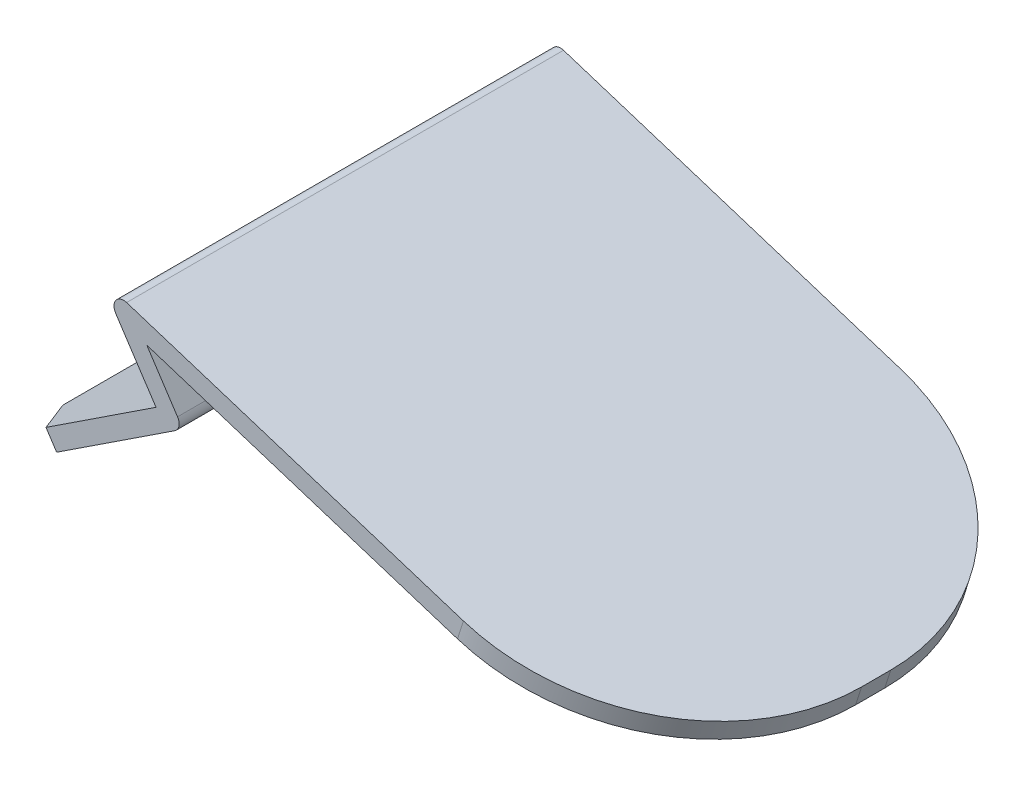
ISO-10303-21;
HEADER;
FILE_DESCRIPTION(('STEP AP214'),'2;1');
FILE_NAME('part.step','',(''),(''),'','','');
FILE_SCHEMA(('AUTOMOTIVE_DESIGN { 1 0 10303 214 1 1 1 1 }'));
ENDSEC;
DATA;
#1=APPLICATION_CONTEXT('core data for automotive mechanical design processes');
#2=APPLICATION_PROTOCOL_DEFINITION('international standard','automotive_design',2000,#1);
#3=PRODUCT_CONTEXT('',#1,'mechanical');
#4=PRODUCT('Part','Part','',(#3));
#5=PRODUCT_RELATED_PRODUCT_CATEGORY('part','',(#4));
#6=PRODUCT_DEFINITION_FORMATION('','',#4);
#7=PRODUCT_DEFINITION_CONTEXT('part definition',#1,'design');
#8=PRODUCT_DEFINITION('design','',#6,#7);
#9=PRODUCT_DEFINITION_SHAPE('','',#8);
#10=(LENGTH_UNIT() NAMED_UNIT(*) SI_UNIT(.MILLI.,.METRE.));
#11=(NAMED_UNIT(*) PLANE_ANGLE_UNIT() SI_UNIT($,.RADIAN.));
#12=(NAMED_UNIT(*) SI_UNIT($,.STERADIAN.) SOLID_ANGLE_UNIT());
#13=UNCERTAINTY_MEASURE_WITH_UNIT(LENGTH_MEASURE(1.E-05),#10,'distance_accuracy_value','');
#14=(GEOMETRIC_REPRESENTATION_CONTEXT(3) GLOBAL_UNCERTAINTY_ASSIGNED_CONTEXT((#13)) GLOBAL_UNIT_ASSIGNED_CONTEXT((#10,
#11,#12)) REPRESENTATION_CONTEXT('',''));
#15=CARTESIAN_POINT('',(0.,0.,0.));
#16=DIRECTION('',(0.,0.,1.));
#17=DIRECTION('',(1.,0.,0.));
#18=AXIS2_PLACEMENT_3D('',#15,#16,#17);
#19=CARTESIAN_POINT('',(-32.0344260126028,-10.8171198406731,45.));
#20=DIRECTION('',(0.835459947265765,0.549551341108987,0.));
#21=DIRECTION('',(-0.549551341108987,0.835459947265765,0.));
#22=AXIS2_PLACEMENT_3D('',#19,#20,#21);
#23=PLANE('',#22);
#24=DIRECTION('',(0.,0.,-1.));
#25=VECTOR('',#24,1.);
#26=CARTESIAN_POINT('',(-33.1335286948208,-9.14619994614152,45.));
#27=LINE('',#26,#25);
#28=CARTESIAN_POINT('',(-33.1335286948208,-9.14619994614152,40.));
#29=VERTEX_POINT('',#28);
#30=CARTESIAN_POINT('',(-33.1335286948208,-9.14619994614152,3.9064281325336));
#31=VERTEX_POINT('',#30);
#32=EDGE_CURVE('E166',#29,#31,#27,.T.);
#33=ORIENTED_EDGE('',*,*,#32,.T.);
#34=DIRECTION('',(0.549551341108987,-0.835459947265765,0.));
#35=VECTOR('',#34,1.);
#36=CARTESIAN_POINT('',(-32.0344260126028,-10.8171198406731,3.9064281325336));
#37=LINE('',#36,#35);
#38=CARTESIAN_POINT('',(-32.0344260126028,-10.817119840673,3.90642813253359));
#39=VERTEX_POINT('',#38);
#40=EDGE_CURVE('E213',#31,#39,#37,.T.);
#41=ORIENTED_EDGE('',*,*,#40,.T.);
#42=DIRECTION('',(0.,0.,-1.));
#43=VECTOR('',#42,1.);
#44=CARTESIAN_POINT('',(-32.0344260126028,-10.8171198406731,45.));
#45=LINE('',#44,#43);
#46=CARTESIAN_POINT('',(-32.0344260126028,-10.8171198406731,40.));
#47=VERTEX_POINT('',#46);
#48=EDGE_CURVE('E152',#47,#39,#45,.T.);
#49=ORIENTED_EDGE('',*,*,#48,.F.);
#50=DIRECTION('',(-0.549551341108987,0.835459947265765,0.));
#51=VECTOR('',#50,1.);
#52=CARTESIAN_POINT('',(-32.0344260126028,-10.8171198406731,40.));
#53=LINE('',#52,#51);
#54=EDGE_CURVE('E211',#47,#29,#53,.T.);
#55=ORIENTED_EDGE('',*,*,#54,.T.);
#56=EDGE_LOOP('',(#33,#41,#49,#55));
#57=FACE_BOUND('',#56,.T.);
#58=ADVANCED_FACE('F31',(#57),#23,.F.);
#59=CARTESIAN_POINT('',(-32.0344260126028,-10.8171198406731,45.));
#60=DIRECTION('',(-0.549551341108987,0.835459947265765,0.));
#61=DIRECTION('',(-0.835459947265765,-0.549551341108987,0.));
#62=AXIS2_PLACEMENT_3D('',#59,#60,#61);
#63=PLANE('',#62);
#64=ORIENTED_EDGE('',*,*,#48,.T.);
#65=DIRECTION('',(0.658351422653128,0.433052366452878,-0.615661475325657));
#66=VECTOR('',#65,1.);
#67=CARTESIAN_POINT('',(-32.0344260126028,-10.8171198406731,3.9064281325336));
#68=LINE('',#67,#66);
#69=CARTESIAN_POINT('',(-27.857126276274,-8.0693631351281,0.));
#70=VERTEX_POINT('',#69);
#71=EDGE_CURVE('E218',#39,#70,#68,.T.);
#72=ORIENTED_EDGE('',*,*,#71,.T.);
#73=DIRECTION('',(0.835459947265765,0.549551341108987,0.));
#74=VECTOR('',#73,1.);
#75=CARTESIAN_POINT('',(-32.0344260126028,-10.8171198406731,0.));
#76=LINE('',#75,#74);
#77=CARTESIAN_POINT('',(-16.605957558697,-0.668535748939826,0.));
#78=VERTEX_POINT('',#77);
#79=EDGE_CURVE('E167',#70,#78,#76,.T.);
#80=ORIENTED_EDGE('',*,*,#79,.T.);
#81=DIRECTION('',(0.,0.,-1.));
#82=VECTOR('',#81,1.);
#83=CARTESIAN_POINT('',(-16.605957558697,-0.668535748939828,45.));
#84=LINE('',#83,#82);
#85=CARTESIAN_POINT('',(-16.605957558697,-0.668535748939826,45.));
#86=VERTEX_POINT('',#85);
#87=EDGE_CURVE('E199',#78,#86,#84,.F.);
#88=ORIENTED_EDGE('',*,*,#87,.T.);
#89=DIRECTION('',(0.835459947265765,0.549551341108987,0.));
#90=VECTOR('',#89,1.);
#91=CARTESIAN_POINT('',(-32.0344260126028,-10.8171198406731,45.));
#92=LINE('',#91,#90);
#93=CARTESIAN_POINT('',(-28.7707617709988,-8.67033702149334,45.));
#94=VERTEX_POINT('',#93);
#95=EDGE_CURVE('E145',#94,#86,#92,.T.);
#96=ORIENTED_EDGE('',*,*,#95,.F.);
#97=DIRECTION('',(0.514360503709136,0.338337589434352,0.788010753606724));
#98=VECTOR('',#97,1.);
#99=CARTESIAN_POINT('',(-28.7707617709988,-8.67033702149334,45.));
#100=LINE('',#99,#98);
#101=EDGE_CURVE('E216',#94,#47,#100,.F.);
#102=ORIENTED_EDGE('',*,*,#101,.T.);
#103=EDGE_LOOP('',(#64,#72,#80,#88,#96,#102));
#104=FACE_BOUND('',#103,.T.);
#105=ADVANCED_FACE('F266',(#104),#63,.F.);
#106=CARTESIAN_POINT('',(-15.7704976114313,-0.118984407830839,45.));
#107=DIRECTION('',(-0.835459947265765,-0.549551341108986,0.));
#108=DIRECTION('',(0.549551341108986,-0.835459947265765,0.));
#109=AXIS2_PLACEMENT_3D('',#106,#107,#108);
#110=PLANE('',#109);
#111=DIRECTION('',(-0.549551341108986,0.835459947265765,0.));
#112=VECTOR('',#111,1.);
#113=CARTESIAN_POINT('',(-15.7704976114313,-0.118984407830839,45.));
#114=LINE('',#113,#112);
#115=CARTESIAN_POINT('',(-16.3200489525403,0.716475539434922,45.));
#116=VERTEX_POINT('',#115);
#117=CARTESIAN_POINT('',(-19.4829196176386,5.52485568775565,45.));
#118=VERTEX_POINT('',#117);
#119=EDGE_CURVE('E135',#116,#118,#114,.T.);
#120=ORIENTED_EDGE('',*,*,#119,.F.);
#121=DIRECTION('',(0.,0.,-1.));
#122=VECTOR('',#121,1.);
#123=CARTESIAN_POINT('',(-16.3200489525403,0.716475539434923,45.));
#124=LINE('',#123,#122);
#125=CARTESIAN_POINT('',(-16.3200489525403,0.716475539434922,0.));
#126=VERTEX_POINT('',#125);
#127=EDGE_CURVE('E191',#116,#126,#124,.T.);
#128=ORIENTED_EDGE('',*,*,#127,.T.);
#129=DIRECTION('',(-0.549551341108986,0.835459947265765,0.));
#130=VECTOR('',#129,1.);
#131=CARTESIAN_POINT('',(-15.7704976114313,-0.118984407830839,0.));
#132=LINE('',#131,#130);
#133=CARTESIAN_POINT('',(-19.4829196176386,5.52485568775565,0.));
#134=VERTEX_POINT('',#133);
#135=EDGE_CURVE('E151',#126,#134,#132,.T.);
#136=ORIENTED_EDGE('',*,*,#135,.T.);
#137=DIRECTION('',(0.,0.,-1.));
#138=VECTOR('',#137,1.);
#139=CARTESIAN_POINT('',(-19.4829196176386,5.52485568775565,45.));
#140=LINE('',#139,#138);
#141=EDGE_CURVE('E148',#118,#134,#140,.T.);
#142=ORIENTED_EDGE('',*,*,#141,.F.);
#143=EDGE_LOOP('',(#120,#128,#136,#142));
#144=FACE_BOUND('',#143,.T.);
#145=ADVANCED_FACE('F149',(#144),#110,.F.);
#146=CARTESIAN_POINT('',(32.5261813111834,-11.0517521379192,45.));
#147=DIRECTION('',(0.303673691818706,0.952776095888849,0.));
#148=DIRECTION('',(-0.952776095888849,0.303673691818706,0.));
#149=AXIS2_PLACEMENT_3D('',#146,#147,#148);
#150=PLANE('',#149);
#151=DIRECTION('',(0.952776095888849,-0.303673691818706,0.));
#152=VECTOR('',#151,1.);
#153=CARTESIAN_POINT('',(32.5261813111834,-11.0517521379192,0.));
#154=LINE('',#153,#152);
#155=CARTESIAN_POINT('',(12.5178832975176,-4.67460460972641,0.));
#156=VERTEX_POINT('',#155);
#157=EDGE_CURVE('E170',#134,#156,#154,.T.);
#158=ORIENTED_EDGE('',*,*,#157,.T.);
#159=CARTESIAN_POINT('',(12.5178832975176,-4.67460460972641,21.));
#160=DIRECTION('',(0.303673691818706,0.952776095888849,0.));
#161=DIRECTION('',(-0.952776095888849,0.303673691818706,0.));
#162=AXIS2_PLACEMENT_3D('',#159,#160,#161);
#163=CIRCLE('',#162,21.);
#164=CARTESIAN_POINT('',(32.5261813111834,-11.0517521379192,21.));
#165=VERTEX_POINT('',#164);
#166=EDGE_CURVE('E39',#156,#165,#163,.F.);
#167=ORIENTED_EDGE('',*,*,#166,.T.);
#168=DIRECTION('',(0.,0.,-1.));
#169=VECTOR('',#168,1.);
#170=CARTESIAN_POINT('',(32.5261813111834,-11.0517521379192,45.));
#171=LINE('',#170,#169);
#172=CARTESIAN_POINT('',(32.5261813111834,-11.0517521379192,24.));
#173=VERTEX_POINT('',#172);
#174=EDGE_CURVE('E153',#173,#165,#171,.T.);
#175=ORIENTED_EDGE('',*,*,#174,.F.);
#176=CARTESIAN_POINT('',(12.5178832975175,-4.6746046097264,24.));
#177=DIRECTION('',(0.303673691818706,0.952776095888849,0.));
#178=DIRECTION('',(-0.952776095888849,0.303673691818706,0.));
#179=AXIS2_PLACEMENT_3D('',#176,#177,#178);
#180=CIRCLE('',#179,21.);
#181=CARTESIAN_POINT('',(12.5178832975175,-4.6746046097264,45.));
#182=VERTEX_POINT('',#181);
#183=EDGE_CURVE('E46',#173,#182,#180,.F.);
#184=ORIENTED_EDGE('',*,*,#183,.T.);
#185=DIRECTION('',(0.952776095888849,-0.303673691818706,0.));
#186=VECTOR('',#185,1.);
#187=CARTESIAN_POINT('',(32.5261813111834,-11.0517521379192,45.));
#188=LINE('',#187,#186);
#189=EDGE_CURVE('E138',#118,#182,#188,.T.);
#190=ORIENTED_EDGE('',*,*,#189,.F.);
#191=ORIENTED_EDGE('',*,*,#141,.T.);
#192=EDGE_LOOP('',(#158,#167,#175,#184,#190,#191));
#193=FACE_BOUND('',#192,.T.);
#194=ADVANCED_FACE('F155',(#193),#150,.F.);
#195=CARTESIAN_POINT('',(33.1335286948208,-9.14619994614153,45.));
#196=DIRECTION('',(-0.952776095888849,0.303673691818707,0.));
#197=DIRECTION('',(-0.303673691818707,-0.952776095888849,0.));
#198=AXIS2_PLACEMENT_3D('',#195,#196,#197);
#199=PLANE('',#198);
#200=ORIENTED_EDGE('',*,*,#174,.T.);
#201=DIRECTION('',(0.303673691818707,0.952776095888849,0.));
#202=VECTOR('',#201,1.);
#203=CARTESIAN_POINT('',(33.1335286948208,-9.14619994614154,21.));
#204=LINE('',#203,#202);
#205=CARTESIAN_POINT('',(33.1335286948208,-9.14619994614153,21.));
#206=VERTEX_POINT('',#205);
#207=EDGE_CURVE('E231',#165,#206,#204,.T.);
#208=ORIENTED_EDGE('',*,*,#207,.T.);
#209=DIRECTION('',(0.,0.,-1.));
#210=VECTOR('',#209,1.);
#211=CARTESIAN_POINT('',(33.1335286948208,-9.14619994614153,45.));
#212=LINE('',#211,#210);
#213=CARTESIAN_POINT('',(33.1335286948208,-9.14619994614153,24.));
#214=VERTEX_POINT('',#213);
#215=EDGE_CURVE('E184',#214,#206,#212,.T.);
#216=ORIENTED_EDGE('',*,*,#215,.F.);
#217=DIRECTION('',(0.303673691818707,0.952776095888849,0.));
#218=VECTOR('',#217,1.);
#219=CARTESIAN_POINT('',(33.1335286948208,-9.14619994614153,24.));
#220=LINE('',#219,#218);
#221=EDGE_CURVE('E229',#214,#173,#220,.F.);
#222=ORIENTED_EDGE('',*,*,#221,.T.);
#223=EDGE_LOOP('',(#200,#208,#216,#222));
#224=FACE_BOUND('',#223,.T.);
#225=ADVANCED_FACE('F243',(#224),#199,.F.);
#226=CARTESIAN_POINT('',(33.1335286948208,-9.14619994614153,45.));
#227=DIRECTION('',(-0.303673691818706,-0.952776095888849,0.));
#228=DIRECTION('',(0.952776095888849,-0.303673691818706,0.));
#229=AXIS2_PLACEMENT_3D('',#226,#227,#228);
#230=PLANE('',#229);
#231=ORIENTED_EDGE('',*,*,#215,.T.);
#232=CARTESIAN_POINT('',(13.125230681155,-2.76905241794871,21.));
#233=DIRECTION('',(-0.303673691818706,-0.952776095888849,0.));
#234=DIRECTION('',(0.952776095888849,-0.303673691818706,0.));
#235=AXIS2_PLACEMENT_3D('',#232,#233,#234);
#236=CIRCLE('',#235,21.);
#237=CARTESIAN_POINT('',(13.125230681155,-2.76905241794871,0.));
#238=VERTEX_POINT('',#237);
#239=EDGE_CURVE('E236',#206,#238,#236,.F.);
#240=ORIENTED_EDGE('',*,*,#239,.T.);
#241=DIRECTION('',(-0.952776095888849,0.303673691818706,0.));
#242=VECTOR('',#241,1.);
#243=CARTESIAN_POINT('',(33.1335286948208,-9.14619994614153,0.));
#244=LINE('',#243,#242);
#245=CARTESIAN_POINT('',(-21.5672207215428,8.28830391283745,0.));
#246=VERTEX_POINT('',#245);
#247=EDGE_CURVE('E172',#238,#246,#244,.T.);
#248=ORIENTED_EDGE('',*,*,#247,.T.);
#249=DIRECTION('',(0.,0.,-1.));
#250=VECTOR('',#249,1.);
#251=CARTESIAN_POINT('',(-21.5672207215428,8.28830391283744,45.));
#252=LINE('',#251,#250);
#253=CARTESIAN_POINT('',(-21.5672207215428,8.28830391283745,45.));
#254=VERTEX_POINT('',#253);
#255=EDGE_CURVE('E208',#246,#254,#252,.F.);
#256=ORIENTED_EDGE('',*,*,#255,.T.);
#257=DIRECTION('',(-0.952776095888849,0.303673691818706,0.));
#258=VECTOR('',#257,1.);
#259=CARTESIAN_POINT('',(33.1335286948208,-9.14619994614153,45.));
#260=LINE('',#259,#258);
#261=CARTESIAN_POINT('',(13.125230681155,-2.7690524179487,45.));
#262=VERTEX_POINT('',#261);
#263=EDGE_CURVE('E156',#262,#254,#260,.T.);
#264=ORIENTED_EDGE('',*,*,#263,.F.);
#265=CARTESIAN_POINT('',(13.125230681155,-2.7690524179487,24.));
#266=DIRECTION('',(-0.303673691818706,-0.952776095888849,0.));
#267=DIRECTION('',(0.952776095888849,-0.303673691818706,0.));
#268=AXIS2_PLACEMENT_3D('',#265,#266,#267);
#269=CIRCLE('',#268,21.);
#270=EDGE_CURVE('E234',#262,#214,#269,.F.);
#271=ORIENTED_EDGE('',*,*,#270,.T.);
#272=EDGE_LOOP('',(#231,#240,#248,#256,#264,#271));
#273=FACE_BOUND('',#272,.T.);
#274=ADVANCED_FACE('F248',(#273),#230,.F.);
#275=CARTESIAN_POINT('',(-18.5405201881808,0.452832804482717,45.));
#276=DIRECTION('',(0.835459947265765,0.549551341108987,0.));
#277=DIRECTION('',(-0.549551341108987,0.835459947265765,0.));
#278=AXIS2_PLACEMENT_3D('',#275,#276,#277);
#279=PLANE('',#278);
#280=DIRECTION('',(0.549551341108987,-0.835459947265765,0.));
#281=VECTOR('',#280,1.);
#282=CARTESIAN_POINT('',(-18.5405201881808,0.452832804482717,45.));
#283=LINE('',#282,#281);
#284=CARTESIAN_POINT('',(-22.7063543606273,6.78597647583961,45.));
#285=VERTEX_POINT('',#284);
#286=CARTESIAN_POINT('',(-18.5405201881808,0.452832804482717,45.));
#287=VERTEX_POINT('',#286);
#288=EDGE_CURVE('E158',#285,#287,#283,.T.);
#289=ORIENTED_EDGE('',*,*,#288,.F.);
#290=DIRECTION('',(0.,0.,-1.));
#291=VECTOR('',#290,1.);
#292=CARTESIAN_POINT('',(-22.7063543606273,6.78597647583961,45.));
#293=LINE('',#292,#291);
#294=CARTESIAN_POINT('',(-22.7063543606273,6.78597647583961,0.));
#295=VERTEX_POINT('',#294);
#296=EDGE_CURVE('E205',#285,#295,#293,.T.);
#297=ORIENTED_EDGE('',*,*,#296,.T.);
#298=DIRECTION('',(0.549551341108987,-0.835459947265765,0.));
#299=VECTOR('',#298,1.);
#300=CARTESIAN_POINT('',(-18.5405201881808,0.452832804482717,0.));
#301=LINE('',#300,#299);
#302=CARTESIAN_POINT('',(-18.5405201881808,0.452832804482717,0.));
#303=VERTEX_POINT('',#302);
#304=EDGE_CURVE('E174',#295,#303,#301,.T.);
#305=ORIENTED_EDGE('',*,*,#304,.T.);
#306=DIRECTION('',(0.,0.,-1.));
#307=VECTOR('',#306,1.);
#308=CARTESIAN_POINT('',(-18.5405201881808,0.452832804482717,45.));
#309=LINE('',#308,#307);
#310=EDGE_CURVE('E181',#287,#303,#309,.T.);
#311=ORIENTED_EDGE('',*,*,#310,.F.);
#312=EDGE_LOOP('',(#289,#297,#305,#311));
#313=FACE_BOUND('',#312,.T.);
#314=ADVANCED_FACE('F300',(#313),#279,.F.);
#315=CARTESIAN_POINT('',(-33.1335286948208,-9.14619994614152,45.));
#316=DIRECTION('',(0.549551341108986,-0.835459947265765,0.));
#317=DIRECTION('',(0.835459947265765,0.549551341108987,0.));
#318=AXIS2_PLACEMENT_3D('',#315,#316,#317);
#319=PLANE('',#318);
#320=DIRECTION('',(-0.835459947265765,-0.549551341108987,0.));
#321=VECTOR('',#320,1.);
#322=CARTESIAN_POINT('',(-33.1335286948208,-9.14619994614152,0.));
#323=LINE('',#322,#321);
#324=CARTESIAN_POINT('',(-28.9562289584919,-6.39844324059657,0.));
#325=VERTEX_POINT('',#324);
#326=EDGE_CURVE('E176',#303,#325,#323,.T.);
#327=ORIENTED_EDGE('',*,*,#326,.T.);
#328=DIRECTION('',(-0.658351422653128,-0.433052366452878,0.615661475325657));
#329=VECTOR('',#328,1.);
#330=CARTESIAN_POINT('',(-33.1335286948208,-9.14619994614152,3.9064281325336));
#331=LINE('',#330,#329);
#332=EDGE_CURVE('E224',#325,#31,#331,.T.);
#333=ORIENTED_EDGE('',*,*,#332,.T.);
#334=ORIENTED_EDGE('',*,*,#32,.F.);
#335=DIRECTION('',(-0.514360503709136,-0.338337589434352,-0.788010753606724));
#336=VECTOR('',#335,1.);
#337=CARTESIAN_POINT('',(-29.8698644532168,-6.99941712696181,45.));
#338=LINE('',#337,#336);
#339=CARTESIAN_POINT('',(-29.8698644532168,-6.99941712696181,45.));
#340=VERTEX_POINT('',#339);
#341=EDGE_CURVE('E222',#29,#340,#338,.F.);
#342=ORIENTED_EDGE('',*,*,#341,.T.);
#343=DIRECTION('',(-0.835459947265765,-0.549551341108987,0.));
#344=VECTOR('',#343,1.);
#345=CARTESIAN_POINT('',(-33.1335286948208,-9.14619994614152,45.));
#346=LINE('',#345,#344);
#347=EDGE_CURVE('E163',#287,#340,#346,.T.);
#348=ORIENTED_EDGE('',*,*,#347,.F.);
#349=ORIENTED_EDGE('',*,*,#310,.T.);
#350=EDGE_LOOP('',(#327,#333,#334,#342,#348,#349));
#351=FACE_BOUND('',#350,.T.);
#352=ADVANCED_FACE('F296',(#351),#319,.F.);
#353=CARTESIAN_POINT('',(-33.1335286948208,-9.14619994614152,45.));
#354=DIRECTION('',(0.,0.,-1.));
#355=DIRECTION('',(-1.,0.,0.));
#356=AXIS2_PLACEMENT_3D('',#353,#354,#355);
#357=PLANE('',#356);
#358=ORIENTED_EDGE('',*,*,#189,.T.);
#359=DIRECTION('',(0.303673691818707,0.952776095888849,0.));
#360=VECTOR('',#359,1.);
#361=CARTESIAN_POINT('',(7.01423432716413,-21.9423012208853,45.));
#362=LINE('',#361,#360);
#363=EDGE_CURVE('E11',#182,#262,#362,.T.);
#364=ORIENTED_EDGE('',*,*,#363,.T.);
#365=ORIENTED_EDGE('',*,*,#263,.T.);
#366=CARTESIAN_POINT('',(-21.8708944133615,7.33552781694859,45.));
#367=DIRECTION('',(0.,0.,-1.));
#368=DIRECTION('',(-1.,0.,0.));
#369=AXIS2_PLACEMENT_3D('',#366,#367,#368);
#370=CIRCLE('',#369,1.);
#371=EDGE_CURVE('E202',#254,#285,#370,.F.);
#372=ORIENTED_EDGE('',*,*,#371,.T.);
#373=ORIENTED_EDGE('',*,*,#288,.T.);
#374=ORIENTED_EDGE('',*,*,#347,.T.);
#375=DIRECTION('',(0.549551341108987,-0.835459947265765,0.));
#376=VECTOR('',#375,1.);
#377=CARTESIAN_POINT('',(-29.8698644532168,-6.99941712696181,45.));
#378=LINE('',#377,#376);
#379=EDGE_CURVE('E226',#340,#94,#378,.T.);
#380=ORIENTED_EDGE('',*,*,#379,.T.);
#381=ORIENTED_EDGE('',*,*,#95,.T.);
#382=CARTESIAN_POINT('',(-17.155508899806,0.166924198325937,45.));
#383=DIRECTION('',(0.,0.,-1.));
#384=DIRECTION('',(-1.,0.,0.));
#385=AXIS2_PLACEMENT_3D('',#382,#383,#384);
#386=CIRCLE('',#385,1.);
#387=EDGE_CURVE('E141',#86,#116,#386,.F.);
#388=ORIENTED_EDGE('',*,*,#387,.T.);
#389=ORIENTED_EDGE('',*,*,#119,.T.);
#390=EDGE_LOOP('',(#358,#364,#365,#372,#373,#374,#380,#381,#388,#389));
#391=FACE_BOUND('',#390,.T.);
#392=ADVANCED_FACE('F137',(#391),#357,.F.);
#393=CARTESIAN_POINT('',(-33.1335286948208,-9.14619994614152,0.));
#394=DIRECTION('',(0.,0.,-1.));
#395=DIRECTION('',(-1.,0.,0.));
#396=AXIS2_PLACEMENT_3D('',#393,#394,#395);
#397=PLANE('',#396);
#398=ORIENTED_EDGE('',*,*,#247,.F.);
#399=DIRECTION('',(0.303673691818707,0.952776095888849,0.));
#400=VECTOR('',#399,1.);
#401=CARTESIAN_POINT('',(12.5178832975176,-4.67460460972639,0.));
#402=LINE('',#401,#400);
#403=EDGE_CURVE('E54',#238,#156,#402,.F.);
#404=ORIENTED_EDGE('',*,*,#403,.T.);
#405=ORIENTED_EDGE('',*,*,#157,.F.);
#406=ORIENTED_EDGE('',*,*,#135,.F.);
#407=CARTESIAN_POINT('',(-17.155508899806,0.166924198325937,0.));
#408=DIRECTION('',(0.,0.,-1.));
#409=DIRECTION('',(-1.,0.,0.));
#410=AXIS2_PLACEMENT_3D('',#407,#408,#409);
#411=CIRCLE('',#410,1.);
#412=EDGE_CURVE('E196',#126,#78,#411,.T.);
#413=ORIENTED_EDGE('',*,*,#412,.T.);
#414=ORIENTED_EDGE('',*,*,#79,.F.);
#415=DIRECTION('',(-0.549551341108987,0.835459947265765,0.));
#416=VECTOR('',#415,1.);
#417=CARTESIAN_POINT('',(-28.9562289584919,-6.39844324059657,0.));
#418=LINE('',#417,#416);
#419=EDGE_CURVE('E220',#70,#325,#418,.T.);
#420=ORIENTED_EDGE('',*,*,#419,.T.);
#421=ORIENTED_EDGE('',*,*,#326,.F.);
#422=ORIENTED_EDGE('',*,*,#304,.F.);
#423=CARTESIAN_POINT('',(-21.8708944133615,7.33552781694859,0.));
#424=DIRECTION('',(0.,0.,-1.));
#425=DIRECTION('',(-1.,0.,0.));
#426=AXIS2_PLACEMENT_3D('',#423,#424,#425);
#427=CIRCLE('',#426,1.);
#428=EDGE_CURVE('E193',#295,#246,#427,.T.);
#429=ORIENTED_EDGE('',*,*,#428,.T.);
#430=EDGE_LOOP('',(#398,#404,#405,#406,#413,#414,#420,#421,#422,#429));
#431=FACE_BOUND('',#430,.T.);
#432=ADVANCED_FACE('F249',(#431),#397,.T.);
#433=CARTESIAN_POINT('',(-17.155508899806,0.166924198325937,45.));
#434=DIRECTION('',(0.,0.,-1.));
#435=DIRECTION('',(-1.,0.,0.));
#436=AXIS2_PLACEMENT_3D('',#433,#434,#435);
#437=CYLINDRICAL_SURFACE('',#436,1.);
#438=ORIENTED_EDGE('',*,*,#387,.F.);
#439=ORIENTED_EDGE('',*,*,#87,.F.);
#440=ORIENTED_EDGE('',*,*,#412,.F.);
#441=ORIENTED_EDGE('',*,*,#127,.F.);
#442=EDGE_LOOP('',(#438,#439,#440,#441));
#443=FACE_BOUND('',#442,.T.);
#444=ADVANCED_FACE('F276',(#443),#437,.T.);
#445=CARTESIAN_POINT('',(-21.8708944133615,7.33552781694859,45.));
#446=DIRECTION('',(0.,0.,-1.));
#447=DIRECTION('',(-1.,0.,0.));
#448=AXIS2_PLACEMENT_3D('',#445,#446,#447);
#449=CYLINDRICAL_SURFACE('',#448,1.);
#450=ORIENTED_EDGE('',*,*,#371,.F.);
#451=ORIENTED_EDGE('',*,*,#255,.F.);
#452=ORIENTED_EDGE('',*,*,#428,.F.);
#453=ORIENTED_EDGE('',*,*,#296,.F.);
#454=EDGE_LOOP('',(#450,#451,#452,#453));
#455=FACE_BOUND('',#454,.T.);
#456=ADVANCED_FACE('F256',(#455),#449,.T.);
#457=CARTESIAN_POINT('',(-32.0344260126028,-10.8171198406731,3.9064281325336));
#458=DIRECTION('',(-0.514360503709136,-0.338337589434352,-0.788010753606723));
#459=DIRECTION('',(-0.837396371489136,0.,0.546596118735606));
#460=AXIS2_PLACEMENT_3D('',#457,#458,#459);
#461=PLANE('',#460);
#462=ORIENTED_EDGE('',*,*,#332,.F.);
#463=ORIENTED_EDGE('',*,*,#419,.F.);
#464=ORIENTED_EDGE('',*,*,#71,.F.);
#465=ORIENTED_EDGE('',*,*,#40,.F.);
#466=EDGE_LOOP('',(#462,#463,#464,#465));
#467=FACE_BOUND('',#466,.T.);
#468=ADVANCED_FACE('F282',(#467),#461,.T.);
#469=CARTESIAN_POINT('',(-29.8698644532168,-6.99941712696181,45.));
#470=DIRECTION('',(0.658351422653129,0.433052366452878,-0.615661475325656));
#471=DIRECTION('',(-0.68302952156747,0.,-0.730390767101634));
#472=AXIS2_PLACEMENT_3D('',#469,#470,#471);
#473=PLANE('',#472);
#474=ORIENTED_EDGE('',*,*,#341,.F.);
#475=ORIENTED_EDGE('',*,*,#54,.F.);
#476=ORIENTED_EDGE('',*,*,#101,.F.);
#477=ORIENTED_EDGE('',*,*,#379,.F.);
#478=EDGE_LOOP('',(#474,#475,#476,#477));
#479=FACE_BOUND('',#478,.T.);
#480=ADVANCED_FACE('F264',(#479),#473,.F.);
#481=CARTESIAN_POINT('',(13.125230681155,-2.76905241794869,21.));
#482=DIRECTION('',(-0.303673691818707,-0.952776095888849,0.));
#483=DIRECTION('',(0.952776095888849,-0.303673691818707,0.));
#484=AXIS2_PLACEMENT_3D('',#481,#482,#483);
#485=CYLINDRICAL_SURFACE('',#484,21.);
#486=ORIENTED_EDGE('',*,*,#166,.F.);
#487=ORIENTED_EDGE('',*,*,#403,.F.);
#488=ORIENTED_EDGE('',*,*,#239,.F.);
#489=ORIENTED_EDGE('',*,*,#207,.F.);
#490=EDGE_LOOP('',(#486,#487,#488,#489));
#491=FACE_BOUND('',#490,.T.);
#492=ADVANCED_FACE('F246',(#491),#485,.T.);
#493=CARTESIAN_POINT('',(7.01423432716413,-21.9423012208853,24.));
#494=DIRECTION('',(0.303673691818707,0.952776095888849,0.));
#495=DIRECTION('',(-0.952776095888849,0.303673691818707,0.));
#496=AXIS2_PLACEMENT_3D('',#493,#494,#495);
#497=CYLINDRICAL_SURFACE('',#496,21.);
#498=ORIENTED_EDGE('',*,*,#183,.F.);
#499=ORIENTED_EDGE('',*,*,#221,.F.);
#500=ORIENTED_EDGE('',*,*,#270,.F.);
#501=ORIENTED_EDGE('',*,*,#363,.F.);
#502=EDGE_LOOP('',(#498,#499,#500,#501));
#503=FACE_BOUND('',#502,.T.);
#504=ADVANCED_FACE('F33',(#503),#497,.T.);
#505=CLOSED_SHELL('',(#58,#105,#145,#194,#225,#274,#314,#352,#392,#432,#444,#456,#468,#480,#492,#504));
#506=MANIFOLD_SOLID_BREP('B2',#505);
#507=ADVANCED_BREP_SHAPE_REPRESENTATION('',(#18,#506),#14);
#508=SHAPE_DEFINITION_REPRESENTATION(#9,#507);
ENDSEC;
END-ISO-10303-21;
